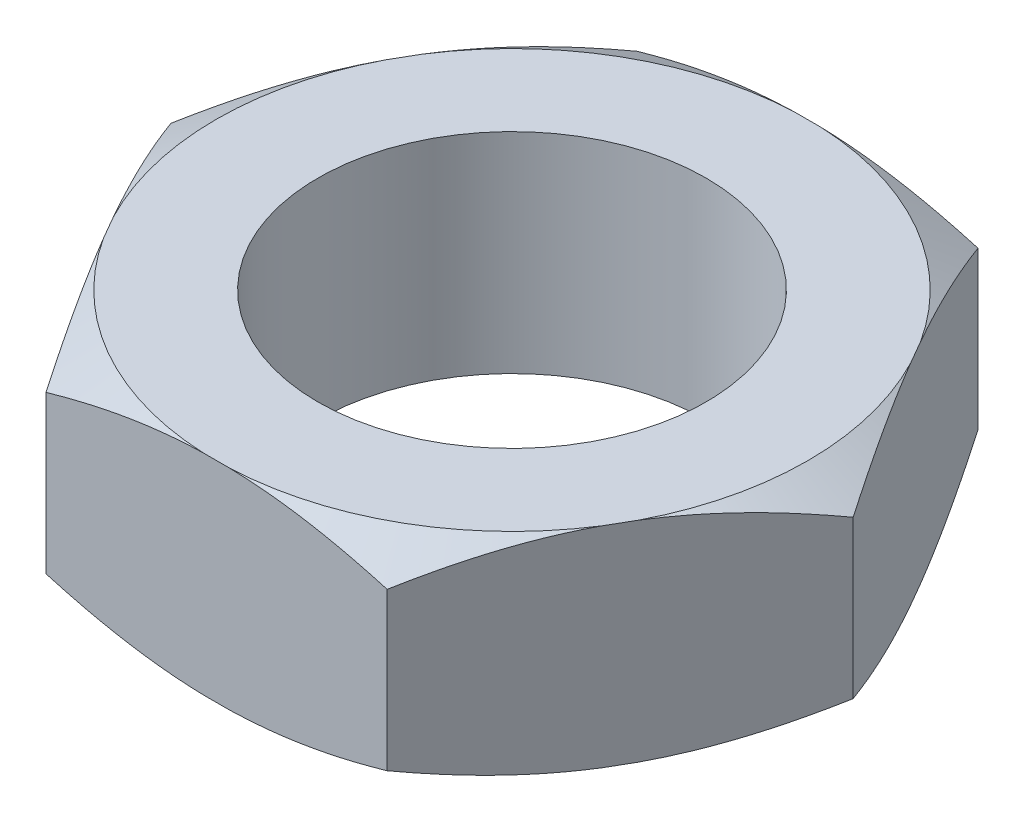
from build123d import *

# Parameters (mm, degrees)
EXTRUDE1_DEPTH     = 2.7
SKETCH3_R          = 2.5
CUT_EXTRUDE1_DEPTH = 3.5


with BuildPart() as part:
    # Sketch2 → Extrude1 (new body)
    with BuildSketch(Plane(origin=(0, 0, 0), x_dir=(1, 0, 0), z_dir=(0, 1, 0))):
        Polygon((4.395, 0), (2.1975, 3.80618165), (-2.1975, 3.80618165), (-4.395, 0), (-2.1975, -3.80618165), (2.1975, -3.80618165), align=None)
    extrude(amount=EXTRUDE1_DEPTH)

    # Sketch3 → Cut-Extrude1 (cut)
    with BuildSketch(Plane(origin=(0, 2.7, 0), x_dir=(-1, 0, 0), z_dir=(0, 1, 0))):
        with Locations(Location((0, 0, 0), (0, 0, 90))):
            Circle(SKETCH3_R)
    extrude(amount=-CUT_EXTRUDE1_DEPTH, mode=Mode.SUBTRACT)

    # Sketch6 → Cut-Revolve1 (revolve, cut)
    with BuildSketch(Plane.XY):
        Polygon((6.747112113, 0), (3.81, 0), (5.632147, 1.052017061), (5.56131586, 1.688877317), (3.81, 2.7), (6.747112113, 2.7), align=None)
    revolve(axis=Axis((0, 0, 0), (0, 1, 0)), mode=Mode.SUBTRACT)


solid = part.part
